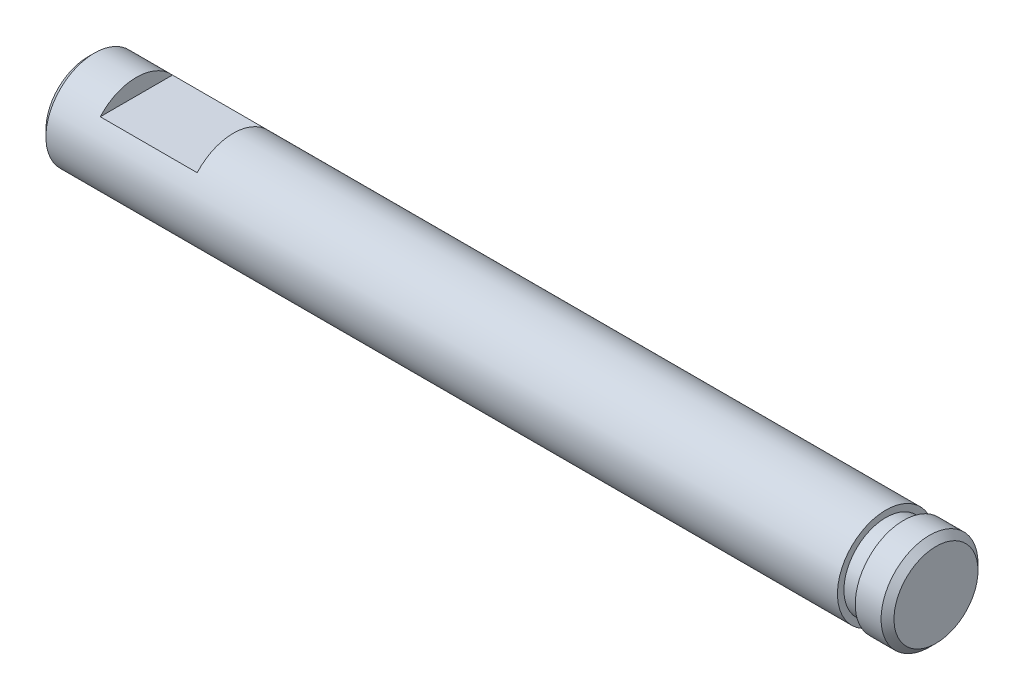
ISO-10303-21;
HEADER;
FILE_DESCRIPTION(('STEP AP214'),'2;1');
FILE_NAME('part.step','',(''),(''),'','','');
FILE_SCHEMA(('AUTOMOTIVE_DESIGN { 1 0 10303 214 1 1 1 1 }'));
ENDSEC;
DATA;
#1=APPLICATION_CONTEXT('core data for automotive mechanical design processes');
#2=APPLICATION_PROTOCOL_DEFINITION('international standard','automotive_design',2000,#1);
#3=PRODUCT_CONTEXT('',#1,'mechanical');
#4=PRODUCT('Part','Part','',(#3));
#5=PRODUCT_RELATED_PRODUCT_CATEGORY('part','',(#4));
#6=PRODUCT_DEFINITION_FORMATION('','',#4);
#7=PRODUCT_DEFINITION_CONTEXT('part definition',#1,'design');
#8=PRODUCT_DEFINITION('design','',#6,#7);
#9=PRODUCT_DEFINITION_SHAPE('','',#8);
#10=(LENGTH_UNIT() NAMED_UNIT(*) SI_UNIT(.MILLI.,.METRE.));
#11=(NAMED_UNIT(*) PLANE_ANGLE_UNIT() SI_UNIT($,.RADIAN.));
#12=(NAMED_UNIT(*) SI_UNIT($,.STERADIAN.) SOLID_ANGLE_UNIT());
#13=UNCERTAINTY_MEASURE_WITH_UNIT(LENGTH_MEASURE(1.E-05),#10,'distance_accuracy_value','');
#14=(GEOMETRIC_REPRESENTATION_CONTEXT(3) GLOBAL_UNCERTAINTY_ASSIGNED_CONTEXT((#13)) GLOBAL_UNIT_ASSIGNED_CONTEXT((#10,
#11,#12)) REPRESENTATION_CONTEXT('',''));
#15=CARTESIAN_POINT('',(0.,0.,0.));
#16=DIRECTION('',(0.,0.,1.));
#17=DIRECTION('',(1.,0.,0.));
#18=AXIS2_PLACEMENT_3D('',#15,#16,#17);
#19=CARTESIAN_POINT('',(0.,0.,0.));
#20=DIRECTION('',(-1.,0.,0.));
#21=DIRECTION('',(0.,0.,1.));
#22=AXIS2_PLACEMENT_3D('',#19,#20,#21);
#23=PLANE('',#22);
#24=CARTESIAN_POINT('',(0.,0.,0.));
#25=DIRECTION('',(1.,0.,0.));
#26=DIRECTION('',(0.,0.,-1.));
#27=AXIS2_PLACEMENT_3D('',#24,#25,#26);
#28=CIRCLE('',#27,1.3);
#29=CARTESIAN_POINT('',(0.,0.,-1.3));
#30=VERTEX_POINT('',#29);
#31=EDGE_CURVE('E85',#30,#30,#28,.T.);
#32=ORIENTED_EDGE('',*,*,#31,.F.);
#33=EDGE_LOOP('',(#32));
#34=FACE_BOUND('',#33,.T.);
#35=ADVANCED_FACE('F33',(#34),#23,.T.);
#36=CARTESIAN_POINT('',(0.199999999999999,0.,0.));
#37=DIRECTION('',(1.,0.,0.));
#38=DIRECTION('',(0.,0.,-1.));
#39=AXIS2_PLACEMENT_3D('',#36,#37,#38);
#40=CONICAL_SURFACE('',#39,1.5,0.785398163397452);
#41=ORIENTED_EDGE('',*,*,#31,.T.);
#42=EDGE_LOOP('',(#41));
#43=FACE_BOUND('',#42,.T.);
#44=CARTESIAN_POINT('',(0.199999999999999,0.,0.));
#45=DIRECTION('',(1.,0.,0.));
#46=DIRECTION('',(0.,0.,-1.));
#47=AXIS2_PLACEMENT_3D('',#44,#45,#46);
#48=CIRCLE('',#47,1.5);
#49=CARTESIAN_POINT('',(0.199999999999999,0.,-1.5));
#50=VERTEX_POINT('',#49);
#51=EDGE_CURVE('E78',#50,#50,#48,.T.);
#52=ORIENTED_EDGE('',*,*,#51,.F.);
#53=EDGE_LOOP('',(#52));
#54=FACE_BOUND('',#53,.T.);
#55=ADVANCED_FACE('F73',(#43,#54),#40,.T.);
#56=CARTESIAN_POINT('',(26.25,0.,0.));
#57=DIRECTION('',(1.,0.,0.));
#58=DIRECTION('',(0.,0.,-1.));
#59=AXIS2_PLACEMENT_3D('',#56,#57,#58);
#60=CYLINDRICAL_SURFACE('',#59,1.5);
#61=DIRECTION('',(1.,0.,0.));
#62=VECTOR('',#61,1.);
#63=CARTESIAN_POINT('',(26.25,0.999999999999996,-1.11803398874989));
#64=LINE('',#63,#62);
#65=CARTESIAN_POINT('',(4.5,0.999999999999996,-1.11803398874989));
#66=VERTEX_POINT('',#65);
#67=CARTESIAN_POINT('',(1.5,0.999999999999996,-1.11803398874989));
#68=VERTEX_POINT('',#67);
#69=EDGE_CURVE('E11',#66,#68,#64,.F.);
#70=ORIENTED_EDGE('',*,*,#69,.F.);
#71=CARTESIAN_POINT('',(4.5,0.,0.));
#72=DIRECTION('',(1.,0.,0.));
#73=DIRECTION('',(0.,0.,-1.));
#74=AXIS2_PLACEMENT_3D('',#71,#72,#73);
#75=CIRCLE('',#74,1.5);
#76=CARTESIAN_POINT('',(4.5,0.999999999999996,1.11803398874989));
#77=VERTEX_POINT('',#76);
#78=EDGE_CURVE('E60',#77,#66,#75,.F.);
#79=ORIENTED_EDGE('',*,*,#78,.F.);
#80=DIRECTION('',(1.,0.,0.));
#81=VECTOR('',#80,1.);
#82=CARTESIAN_POINT('',(26.25,0.999999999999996,1.11803398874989));
#83=LINE('',#82,#81);
#84=CARTESIAN_POINT('',(1.5,0.999999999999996,1.11803398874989));
#85=VERTEX_POINT('',#84);
#86=EDGE_CURVE('E64',#85,#77,#83,.T.);
#87=ORIENTED_EDGE('',*,*,#86,.F.);
#88=CARTESIAN_POINT('',(1.5,0.,0.));
#89=DIRECTION('',(-1.,0.,0.));
#90=DIRECTION('',(0.,-1.,0.));
#91=AXIS2_PLACEMENT_3D('',#88,#89,#90);
#92=CIRCLE('',#91,1.5);
#93=EDGE_CURVE('E40',#68,#85,#92,.F.);
#94=ORIENTED_EDGE('',*,*,#93,.F.);
#95=EDGE_LOOP('',(#70,#79,#87,#94));
#96=FACE_BOUND('',#95,.T.);
#97=ORIENTED_EDGE('',*,*,#51,.T.);
#98=EDGE_LOOP('',(#97));
#99=FACE_BOUND('',#98,.T.);
#100=CARTESIAN_POINT('',(24.7,0.,0.));
#101=DIRECTION('',(1.,0.,0.));
#102=DIRECTION('',(0.,0.,-1.));
#103=AXIS2_PLACEMENT_3D('',#100,#101,#102);
#104=CIRCLE('',#103,1.5);
#105=CARTESIAN_POINT('',(24.7,0.,-1.5));
#106=VERTEX_POINT('',#105);
#107=EDGE_CURVE('E81',#106,#106,#104,.T.);
#108=ORIENTED_EDGE('',*,*,#107,.F.);
#109=EDGE_LOOP('',(#108));
#110=FACE_BOUND('',#109,.T.);
#111=ADVANCED_FACE('F69',(#96,#99,#110),#60,.T.);
#112=CARTESIAN_POINT('',(24.7,1.5,0.));
#113=DIRECTION('',(1.,0.,0.));
#114=DIRECTION('',(0.,0.,-1.));
#115=AXIS2_PLACEMENT_3D('',#112,#113,#114);
#116=PLANE('',#115);
#117=ORIENTED_EDGE('',*,*,#107,.T.);
#118=EDGE_LOOP('',(#117));
#119=FACE_BOUND('',#118,.T.);
#120=CARTESIAN_POINT('',(24.7,0.,0.));
#121=DIRECTION('',(1.,0.,0.));
#122=DIRECTION('',(0.,0.,-1.));
#123=AXIS2_PLACEMENT_3D('',#120,#121,#122);
#124=CIRCLE('',#123,1.3);
#125=CARTESIAN_POINT('',(24.7,0.,-1.3));
#126=VERTEX_POINT('',#125);
#127=EDGE_CURVE('E83',#126,#126,#124,.T.);
#128=ORIENTED_EDGE('',*,*,#127,.F.);
#129=EDGE_LOOP('',(#128));
#130=FACE_BOUND('',#129,.T.);
#131=ADVANCED_FACE('F72',(#119,#130),#116,.T.);
#132=CARTESIAN_POINT('',(26.25,0.,0.));
#133=DIRECTION('',(1.,0.,0.));
#134=DIRECTION('',(0.,0.,-1.));
#135=AXIS2_PLACEMENT_3D('',#132,#133,#134);
#136=CYLINDRICAL_SURFACE('',#135,1.3);
#137=ORIENTED_EDGE('',*,*,#127,.T.);
#138=EDGE_LOOP('',(#137));
#139=FACE_BOUND('',#138,.T.);
#140=CARTESIAN_POINT('',(25.25,0.,0.));
#141=DIRECTION('',(1.,0.,0.));
#142=DIRECTION('',(0.,0.,-1.));
#143=AXIS2_PLACEMENT_3D('',#140,#141,#142);
#144=CIRCLE('',#143,1.3);
#145=CARTESIAN_POINT('',(25.25,0.,-1.3));
#146=VERTEX_POINT('',#145);
#147=EDGE_CURVE('E88',#146,#146,#144,.T.);
#148=ORIENTED_EDGE('',*,*,#147,.F.);
#149=EDGE_LOOP('',(#148));
#150=FACE_BOUND('',#149,.T.);
#151=ADVANCED_FACE('F111',(#139,#150),#136,.T.);
#152=CARTESIAN_POINT('',(25.25,1.3,0.));
#153=DIRECTION('',(-1.,0.,0.));
#154=DIRECTION('',(0.,0.,1.));
#155=AXIS2_PLACEMENT_3D('',#152,#153,#154);
#156=PLANE('',#155);
#157=ORIENTED_EDGE('',*,*,#147,.T.);
#158=EDGE_LOOP('',(#157));
#159=FACE_BOUND('',#158,.T.);
#160=CARTESIAN_POINT('',(25.25,0.,0.));
#161=DIRECTION('',(1.,0.,0.));
#162=DIRECTION('',(0.,0.,-1.));
#163=AXIS2_PLACEMENT_3D('',#160,#161,#162);
#164=CIRCLE('',#163,1.5);
#165=CARTESIAN_POINT('',(25.25,0.,-1.5));
#166=VERTEX_POINT('',#165);
#167=EDGE_CURVE('E103',#166,#166,#164,.T.);
#168=ORIENTED_EDGE('',*,*,#167,.F.);
#169=EDGE_LOOP('',(#168));
#170=FACE_BOUND('',#169,.T.);
#171=ADVANCED_FACE('F108',(#159,#170),#156,.T.);
#172=CARTESIAN_POINT('',(26.25,0.,0.));
#173=DIRECTION('',(1.,0.,0.));
#174=DIRECTION('',(0.,0.,-1.));
#175=AXIS2_PLACEMENT_3D('',#172,#173,#174);
#176=CYLINDRICAL_SURFACE('',#175,1.5);
#177=ORIENTED_EDGE('',*,*,#167,.T.);
#178=EDGE_LOOP('',(#177));
#179=FACE_BOUND('',#178,.T.);
#180=CARTESIAN_POINT('',(26.05,0.,0.));
#181=DIRECTION('',(1.,0.,0.));
#182=DIRECTION('',(0.,0.,-1.));
#183=AXIS2_PLACEMENT_3D('',#180,#181,#182);
#184=CIRCLE('',#183,1.5);
#185=CARTESIAN_POINT('',(26.05,0.,-1.5));
#186=VERTEX_POINT('',#185);
#187=EDGE_CURVE('E100',#186,#186,#184,.T.);
#188=ORIENTED_EDGE('',*,*,#187,.F.);
#189=EDGE_LOOP('',(#188));
#190=FACE_BOUND('',#189,.T.);
#191=ADVANCED_FACE('F119',(#179,#190),#176,.T.);
#192=CARTESIAN_POINT('',(26.25,0.,0.));
#193=DIRECTION('',(-1.,0.,0.));
#194=DIRECTION('',(0.,0.,1.));
#195=AXIS2_PLACEMENT_3D('',#192,#193,#194);
#196=CONICAL_SURFACE('',#195,1.3,0.785398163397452);
#197=ORIENTED_EDGE('',*,*,#187,.T.);
#198=EDGE_LOOP('',(#197));
#199=FACE_BOUND('',#198,.T.);
#200=CARTESIAN_POINT('',(26.25,0.,0.));
#201=DIRECTION('',(1.,0.,0.));
#202=DIRECTION('',(0.,0.,-1.));
#203=AXIS2_PLACEMENT_3D('',#200,#201,#202);
#204=CIRCLE('',#203,1.3);
#205=CARTESIAN_POINT('',(26.25,0.,-1.3));
#206=VERTEX_POINT('',#205);
#207=EDGE_CURVE('E67',#206,#206,#204,.T.);
#208=ORIENTED_EDGE('',*,*,#207,.F.);
#209=EDGE_LOOP('',(#208));
#210=FACE_BOUND('',#209,.T.);
#211=ADVANCED_FACE('F161',(#199,#210),#196,.T.);
#212=CARTESIAN_POINT('',(26.25,1.3,0.));
#213=DIRECTION('',(1.,0.,0.));
#214=DIRECTION('',(0.,0.,-1.));
#215=AXIS2_PLACEMENT_3D('',#212,#213,#214);
#216=PLANE('',#215);
#217=ORIENTED_EDGE('',*,*,#207,.T.);
#218=EDGE_LOOP('',(#217));
#219=FACE_BOUND('',#218,.T.);
#220=ADVANCED_FACE('F170',(#219),#216,.T.);
#221=CARTESIAN_POINT('',(1.5,1.5,-1.5));
#222=DIRECTION('',(-1.,0.,0.));
#223=DIRECTION('',(0.,-1.,0.));
#224=AXIS2_PLACEMENT_3D('',#221,#222,#223);
#225=PLANE('',#224);
#226=DIRECTION('',(0.,0.,1.));
#227=VECTOR('',#226,1.);
#228=CARTESIAN_POINT('',(1.5,0.999999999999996,-1.5));
#229=LINE('',#228,#227);
#230=EDGE_CURVE('E46',#68,#85,#229,.T.);
#231=ORIENTED_EDGE('',*,*,#230,.F.);
#232=ORIENTED_EDGE('',*,*,#93,.T.);
#233=EDGE_LOOP('',(#231,#232));
#234=FACE_BOUND('',#233,.T.);
#235=ADVANCED_FACE('F95',(#234),#225,.F.);
#236=CARTESIAN_POINT('',(4.5,1.5,-1.5));
#237=DIRECTION('',(1.,0.,0.));
#238=DIRECTION('',(0.,0.,-1.));
#239=AXIS2_PLACEMENT_3D('',#236,#237,#238);
#240=PLANE('',#239);
#241=ORIENTED_EDGE('',*,*,#78,.T.);
#242=DIRECTION('',(0.,0.,1.));
#243=VECTOR('',#242,1.);
#244=CARTESIAN_POINT('',(4.5,0.999999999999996,-1.5));
#245=LINE('',#244,#243);
#246=EDGE_CURVE('E63',#66,#77,#245,.T.);
#247=ORIENTED_EDGE('',*,*,#246,.T.);
#248=EDGE_LOOP('',(#241,#247));
#249=FACE_BOUND('',#248,.T.);
#250=ADVANCED_FACE('F62',(#249),#240,.F.);
#251=CARTESIAN_POINT('',(1.5,0.999999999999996,-1.5));
#252=DIRECTION('',(0.,-1.,0.));
#253=DIRECTION('',(0.,0.,-1.));
#254=AXIS2_PLACEMENT_3D('',#251,#252,#253);
#255=PLANE('',#254);
#256=ORIENTED_EDGE('',*,*,#69,.T.);
#257=ORIENTED_EDGE('',*,*,#230,.T.);
#258=ORIENTED_EDGE('',*,*,#86,.T.);
#259=ORIENTED_EDGE('',*,*,#246,.F.);
#260=EDGE_LOOP('',(#256,#257,#258,#259));
#261=FACE_BOUND('',#260,.T.);
#262=ADVANCED_FACE('F66',(#261),#255,.F.);
#263=CLOSED_SHELL('',(#35,#55,#111,#131,#151,#171,#191,#211,#220,#235,#250,#262));
#264=MANIFOLD_SOLID_BREP('B2',#263);
#265=ADVANCED_BREP_SHAPE_REPRESENTATION('',(#18,#264),#14);
#266=SHAPE_DEFINITION_REPRESENTATION(#9,#265);
ENDSEC;
END-ISO-10303-21;
